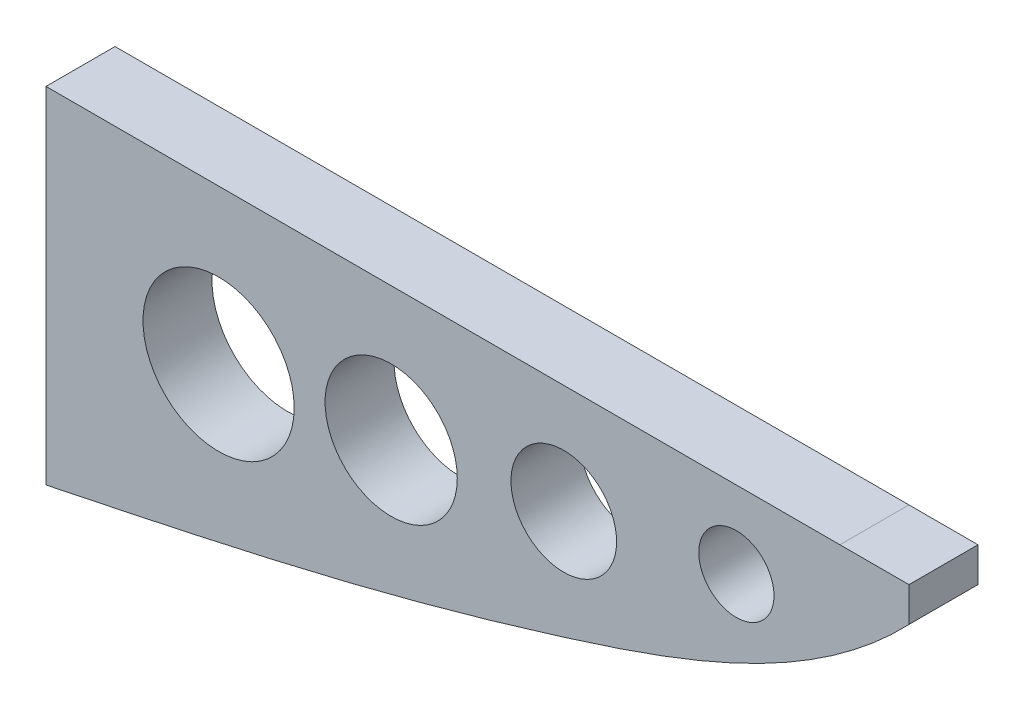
from build123d import *

# Parameters (mm, degrees)
AUFSATZ_LINEAR_AUSTRAGEN1_DEPTH = 20
SKIZZE3_R                       = 10.9
SKIZZE3_R_2                     = 15.3
SKIZZE3_R_3                     = 19.15
SKIZZE3_R_4                     = 21.9
SCHNITT_LINEAR_AUSTRAGEN1_DEPTH = 256.734237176


with BuildPart() as part:
    # Skizze1 → Aufsatz-Linear austragen1 (new body)
    with BuildSketch(Plane.XY):
        with BuildLine():
            Line((0, -50), (0, 50))
            Line((0, 50), (250, 50))
            Line((250, 50), (250, 40))
            add(Edge.make_bspline(
                [(0, -50), (33.41994869, -43.060858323), (83.963255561, -32.55419778), (169.944017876, -7.883209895), (222.615387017, 11.374413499), (250, 40)],
                knots=[0, 0, 0, 0, 0.381514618, 0.575066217, 1, 1, 1, 1], degree=3))
        make_face()
    extrude(amount=AUFSATZ_LINEAR_AUSTRAGEN1_DEPTH)

    # Skizze3 → Schnitt-Linear austragen1 (cut, through all)
    with BuildSketch(Plane.XY.offset(20)):
        with Locations((200, 27.65)):
            Circle(SKIZZE3_R)
        with Locations((150, 18.4)):
            Circle(SKIZZE3_R_2)
        with Locations((100, 11.25)):
            Circle(SKIZZE3_R_3)
        with Locations((50, 5.3)):
            Circle(SKIZZE3_R_4)
    extrude(amount=-SCHNITT_LINEAR_AUSTRAGEN1_DEPTH, mode=Mode.SUBTRACT)


solid = part.part
